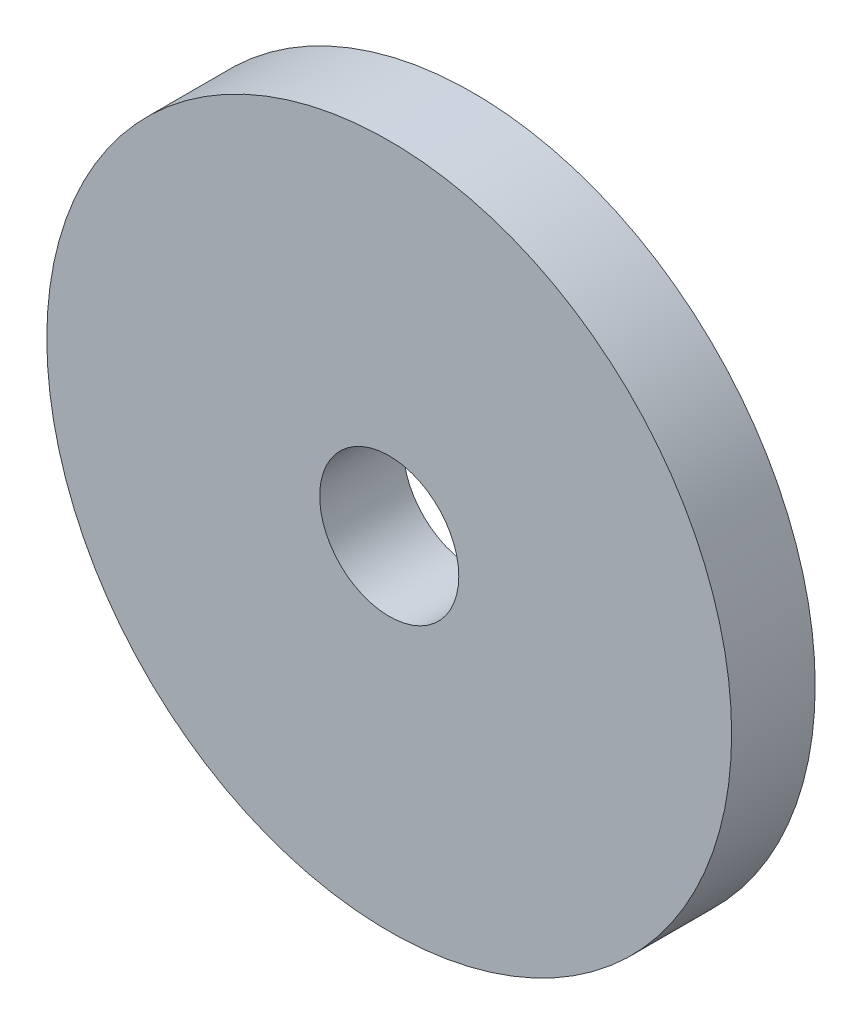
ISO-10303-21;
HEADER;
FILE_DESCRIPTION(('STEP AP214'),'2;1');
FILE_NAME('part.step','',(''),(''),'','','');
FILE_SCHEMA(('AUTOMOTIVE_DESIGN { 1 0 10303 214 1 1 1 1 }'));
ENDSEC;
DATA;
#1=APPLICATION_CONTEXT('core data for automotive mechanical design processes');
#2=APPLICATION_PROTOCOL_DEFINITION('international standard','automotive_design',2000,#1);
#3=PRODUCT_CONTEXT('',#1,'mechanical');
#4=PRODUCT('Part','Part','',(#3));
#5=PRODUCT_RELATED_PRODUCT_CATEGORY('part','',(#4));
#6=PRODUCT_DEFINITION_FORMATION('','',#4);
#7=PRODUCT_DEFINITION_CONTEXT('part definition',#1,'design');
#8=PRODUCT_DEFINITION('design','',#6,#7);
#9=PRODUCT_DEFINITION_SHAPE('','',#8);
#10=(LENGTH_UNIT() NAMED_UNIT(*) SI_UNIT(.MILLI.,.METRE.));
#11=(NAMED_UNIT(*) PLANE_ANGLE_UNIT() SI_UNIT($,.RADIAN.));
#12=(NAMED_UNIT(*) SI_UNIT($,.STERADIAN.) SOLID_ANGLE_UNIT());
#13=UNCERTAINTY_MEASURE_WITH_UNIT(LENGTH_MEASURE(1.E-05),#10,'distance_accuracy_value','');
#14=(GEOMETRIC_REPRESENTATION_CONTEXT(3) GLOBAL_UNCERTAINTY_ASSIGNED_CONTEXT((#13)) GLOBAL_UNIT_ASSIGNED_CONTEXT((#10,
#11,#12)) REPRESENTATION_CONTEXT('',''));
#15=CARTESIAN_POINT('',(0.,0.,0.));
#16=DIRECTION('',(0.,0.,1.));
#17=DIRECTION('',(1.,0.,0.));
#18=AXIS2_PLACEMENT_3D('',#15,#16,#17);
#19=CARTESIAN_POINT('',(0.,0.,3.0988));
#20=DIRECTION('',(0.,0.,-1.));
#21=DIRECTION('',(-1.,0.,0.));
#22=AXIS2_PLACEMENT_3D('',#19,#20,#21);
#23=PLANE('',#22);
#24=CARTESIAN_POINT('',(0.,0.,3.0988));
#25=DIRECTION('',(0.,0.,1.));
#26=DIRECTION('',(1.,0.,0.));
#27=AXIS2_PLACEMENT_3D('',#24,#25,#26);
#28=CIRCLE('',#27,2.5796875);
#29=CARTESIAN_POINT('',(2.5796875,0.,3.0988));
#30=VERTEX_POINT('',#29);
#31=EDGE_CURVE('E43',#30,#30,#28,.F.);
#32=ORIENTED_EDGE('',*,*,#31,.T.);
#33=EDGE_LOOP('',(#32));
#34=FACE_BOUND('',#33,.T.);
#35=CARTESIAN_POINT('',(0.,0.,3.0988));
#36=DIRECTION('',(0.,0.,1.));
#37=DIRECTION('',(1.,0.,0.));
#38=AXIS2_PLACEMENT_3D('',#35,#36,#37);
#39=CIRCLE('',#38,12.7);
#40=CARTESIAN_POINT('',(12.7,0.,3.0988));
#41=VERTEX_POINT('',#40);
#42=EDGE_CURVE('E22',#41,#41,#39,.F.);
#43=ORIENTED_EDGE('',*,*,#42,.F.);
#44=EDGE_LOOP('',(#43));
#45=FACE_BOUND('',#44,.T.);
#46=ADVANCED_FACE('F19',(#34,#45),#23,.F.);
#47=CARTESIAN_POINT('',(0.,0.,0.));
#48=DIRECTION('',(0.,0.,1.));
#49=DIRECTION('',(1.,0.,0.));
#50=AXIS2_PLACEMENT_3D('',#47,#48,#49);
#51=CYLINDRICAL_SURFACE('',#50,12.7);
#52=CARTESIAN_POINT('',(0.,0.,0.));
#53=DIRECTION('',(0.,0.,1.));
#54=DIRECTION('',(1.,0.,0.));
#55=AXIS2_PLACEMENT_3D('',#52,#53,#54);
#56=CIRCLE('',#55,12.7);
#57=CARTESIAN_POINT('',(12.7,0.,0.));
#58=VERTEX_POINT('',#57);
#59=EDGE_CURVE('E28',#58,#58,#56,.F.);
#60=ORIENTED_EDGE('',*,*,#59,.F.);
#61=EDGE_LOOP('',(#60));
#62=FACE_BOUND('',#61,.T.);
#63=ORIENTED_EDGE('',*,*,#42,.T.);
#64=EDGE_LOOP('',(#63));
#65=FACE_BOUND('',#64,.T.);
#66=ADVANCED_FACE('F65',(#62,#65),#51,.T.);
#67=CARTESIAN_POINT('',(0.,0.,0.));
#68=DIRECTION('',(0.,0.,1.));
#69=DIRECTION('',(1.,0.,0.));
#70=AXIS2_PLACEMENT_3D('',#67,#68,#69);
#71=CYLINDRICAL_SURFACE('',#70,2.5796875);
#72=CARTESIAN_POINT('',(0.,0.,0.));
#73=DIRECTION('',(0.,0.,1.));
#74=DIRECTION('',(1.,0.,0.));
#75=AXIS2_PLACEMENT_3D('',#72,#73,#74);
#76=CIRCLE('',#75,2.5796875);
#77=CARTESIAN_POINT('',(2.5796875,0.,0.));
#78=VERTEX_POINT('',#77);
#79=EDGE_CURVE('E11',#78,#78,#76,.T.);
#80=ORIENTED_EDGE('',*,*,#79,.F.);
#81=EDGE_LOOP('',(#80));
#82=FACE_BOUND('',#81,.T.);
#83=ORIENTED_EDGE('',*,*,#31,.F.);
#84=EDGE_LOOP('',(#83));
#85=FACE_BOUND('',#84,.T.);
#86=ADVANCED_FACE('F50',(#82,#85),#71,.F.);
#87=CARTESIAN_POINT('',(0.,0.,0.));
#88=DIRECTION('',(0.,0.,-1.));
#89=DIRECTION('',(-1.,0.,0.));
#90=AXIS2_PLACEMENT_3D('',#87,#88,#89);
#91=PLANE('',#90);
#92=ORIENTED_EDGE('',*,*,#79,.T.);
#93=EDGE_LOOP('',(#92));
#94=FACE_BOUND('',#93,.T.);
#95=ORIENTED_EDGE('',*,*,#59,.T.);
#96=EDGE_LOOP('',(#95));
#97=FACE_BOUND('',#96,.T.);
#98=ADVANCED_FACE('F53',(#94,#97),#91,.T.);
#99=CLOSED_SHELL('',(#46,#66,#86,#98));
#100=MANIFOLD_SOLID_BREP('B1',#99);
#101=ADVANCED_BREP_SHAPE_REPRESENTATION('',(#18,#100),#14);
#102=SHAPE_DEFINITION_REPRESENTATION(#9,#101);
ENDSEC;
END-ISO-10303-21;
